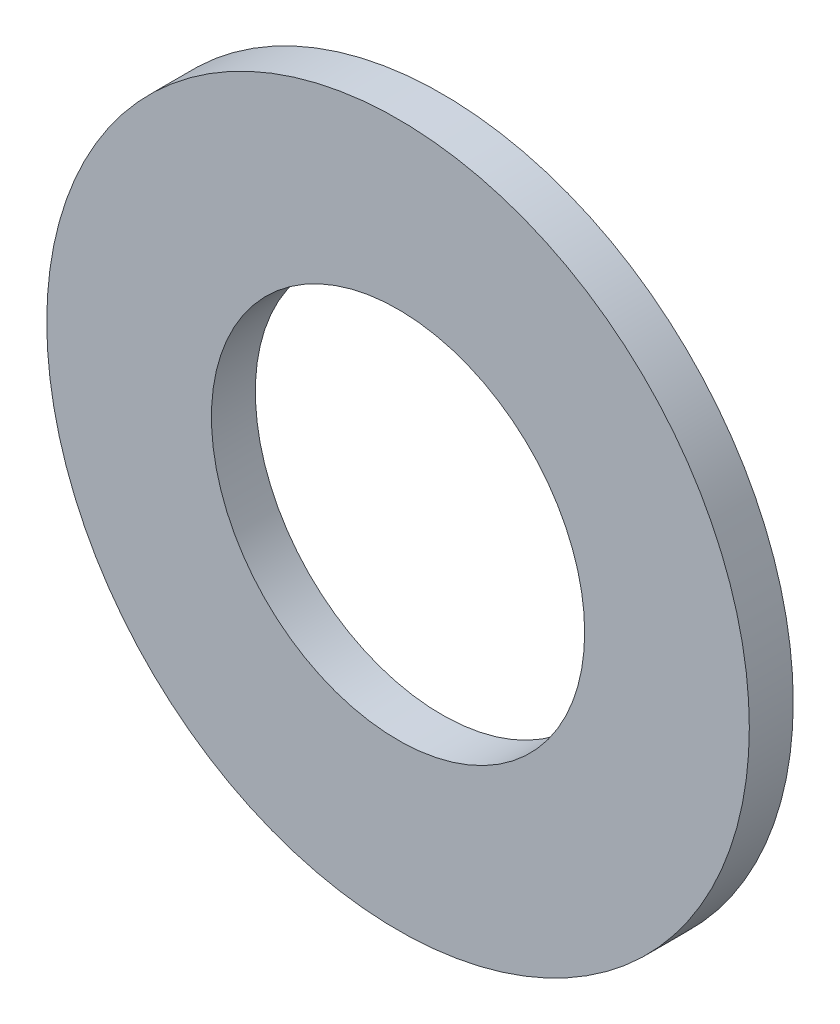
from build123d import *

# Parameters (mm, degrees)
SKETCH1_R           = 50.8
SKETCH1_R_2         = 26.9875
BOSS_EXTRUDE1_DEPTH = 3.175


with BuildPart() as part:
    # Sketch1 → Boss-Extrude1 (new, symmetric)
    with BuildSketch(Plane(origin=(0, 0, 0), x_dir=(0, 1, 0), z_dir=(0, 0, 1))):
        with Locations(Location((0, 0, 0), (0, 0, 270))):
            Circle(SKETCH1_R)
        with Locations(Location((0, 0, 0), (0, 0, 270))):
            Circle(SKETCH1_R_2, mode=Mode.SUBTRACT)
    extrude(amount=BOSS_EXTRUDE1_DEPTH, both=True)


solid = part.part
